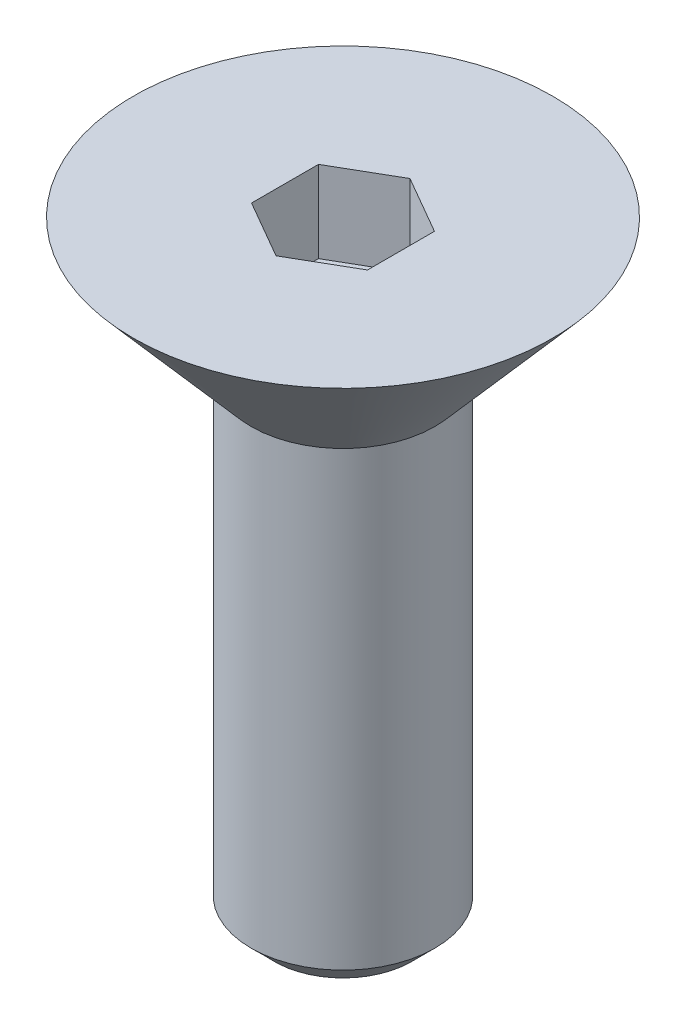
from build123d import *

# Parameters (mm, degrees)
CUT_EXTRUDE1_DEPTH = 1.1176


with BuildPart() as part:
    # Sketch1 → Base-Revolve (revolve)
    with BuildSketch(Plane.XY, mode=Mode.PRIVATE) as base_revolve_sk:
        Polygon((0, 0), (1.2573, 0), (2.8702, 1.8542), (0, 1.8542), align=None)
    revolve(base_revolve_sk.sketch.rotate(Axis((0, 0, 0), (0, 1, 0)), 90), axis=Axis((0, 0, 0), (0, 1, 0)))

    # Sketch2 → Boss-Revolve1 (revolve)
    with BuildSketch(Plane.XY, mode=Mode.PRIVATE) as boss_revolve1_sk:
        Polygon((0, -6.5), (0.94107, -6.5), (1.2573, -6.18377), (1.2573, 0), (0, 0), align=None)
    revolve(boss_revolve1_sk.sketch.rotate(Axis((0, 0, 0), (0, 1, 0)), 90), axis=Axis((0, 0, 0), (0, 1, 0)))

    # Sketch3 → Cut-Extrude1 (cut)
    with BuildSketch(Plane(origin=(0, 1.8542, 0), x_dir=(-1, 0, 0), z_dir=(0, 1, 0))):
        Polygon((0.79375, 0.458271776), (0, 0.916543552), (-0.79375, 0.458271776), (-0.79375, -0.458271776), (0, -0.916543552), (0.79375, -0.458271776), align=None)
    extrude(amount=-CUT_EXTRUDE1_DEPTH, mode=Mode.SUBTRACT)


solid = part.part
